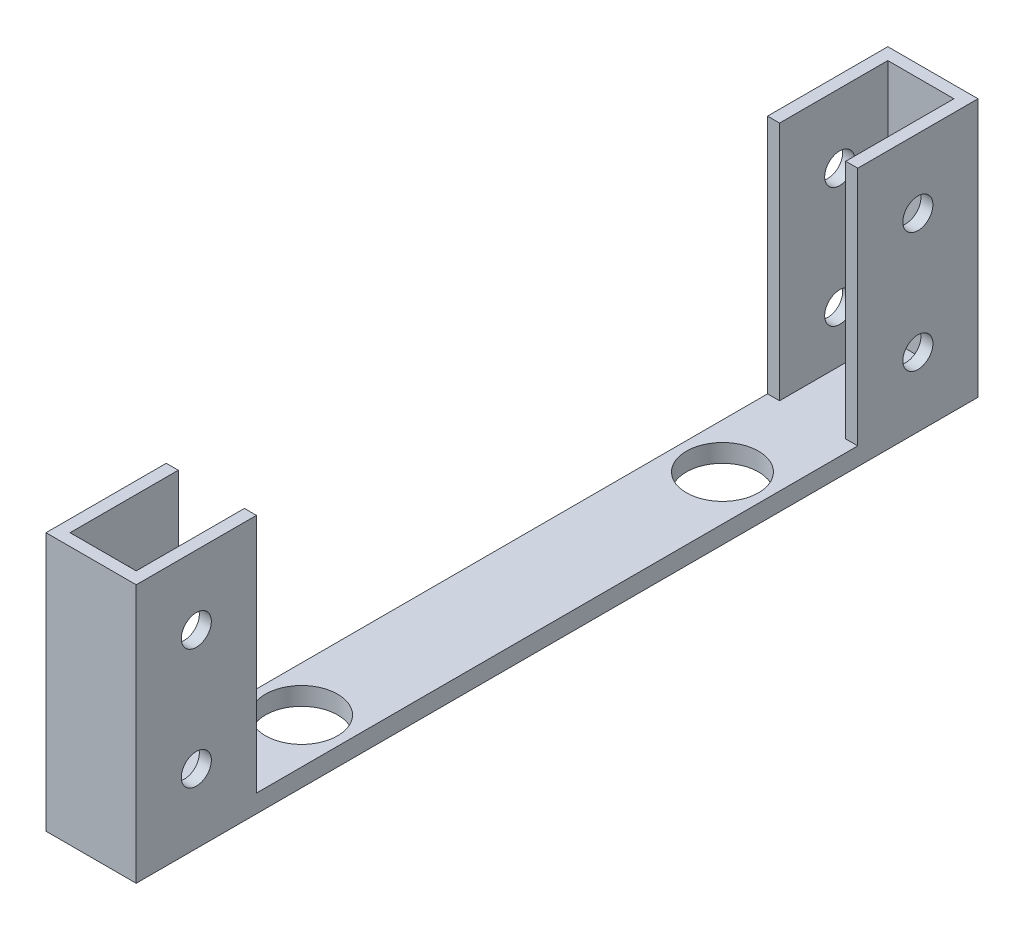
ISO-10303-21;
HEADER;
FILE_DESCRIPTION(('STEP AP214'),'2;1');
FILE_NAME('part.step','',(''),(''),'','','');
FILE_SCHEMA(('AUTOMOTIVE_DESIGN { 1 0 10303 214 1 1 1 1 }'));
ENDSEC;
DATA;
#1=APPLICATION_CONTEXT('core data for automotive mechanical design processes');
#2=APPLICATION_PROTOCOL_DEFINITION('international standard','automotive_design',2000,#1);
#3=PRODUCT_CONTEXT('',#1,'mechanical');
#4=PRODUCT('Part','Part','',(#3));
#5=PRODUCT_RELATED_PRODUCT_CATEGORY('part','',(#4));
#6=PRODUCT_DEFINITION_FORMATION('','',#4);
#7=PRODUCT_DEFINITION_CONTEXT('part definition',#1,'design');
#8=PRODUCT_DEFINITION('design','',#6,#7);
#9=PRODUCT_DEFINITION_SHAPE('','',#8);
#10=(LENGTH_UNIT() NAMED_UNIT(*) SI_UNIT(.MILLI.,.METRE.));
#11=(NAMED_UNIT(*) PLANE_ANGLE_UNIT() SI_UNIT($,.RADIAN.));
#12=(NAMED_UNIT(*) SI_UNIT($,.STERADIAN.) SOLID_ANGLE_UNIT());
#13=UNCERTAINTY_MEASURE_WITH_UNIT(LENGTH_MEASURE(1.E-05),#10,'distance_accuracy_value','');
#14=(GEOMETRIC_REPRESENTATION_CONTEXT(3) GLOBAL_UNCERTAINTY_ASSIGNED_CONTEXT((#13)) GLOBAL_UNIT_ASSIGNED_CONTEXT((#10,
#11,#12)) REPRESENTATION_CONTEXT('',''));
#15=CARTESIAN_POINT('',(0.,0.,0.));
#16=DIRECTION('',(0.,0.,1.));
#17=DIRECTION('',(1.,0.,0.));
#18=AXIS2_PLACEMENT_3D('',#15,#16,#17);
#19=CARTESIAN_POINT('',(0.,3.,0.));
#20=DIRECTION('',(0.,1.,0.));
#21=DIRECTION('',(0.,0.,1.));
#22=AXIS2_PLACEMENT_3D('',#19,#20,#21);
#23=PLANE('',#22);
#24=CARTESIAN_POINT('',(0.,3.,35.));
#25=DIRECTION('',(0.,1.,0.));
#26=DIRECTION('',(0.,0.,1.));
#27=AXIS2_PLACEMENT_3D('',#24,#25,#26);
#28=CIRCLE('',#27,6.);
#29=CARTESIAN_POINT('',(0.,3.,41.));
#30=VERTEX_POINT('',#29);
#31=EDGE_CURVE('E264',#30,#30,#28,.T.);
#32=ORIENTED_EDGE('',*,*,#31,.F.);
#33=EDGE_LOOP('',(#32));
#34=FACE_BOUND('',#33,.T.);
#35=CARTESIAN_POINT('',(0.,3.,-35.));
#36=DIRECTION('',(0.,1.,0.));
#37=DIRECTION('',(0.,0.,1.));
#38=AXIS2_PLACEMENT_3D('',#35,#36,#37);
#39=CIRCLE('',#38,6.);
#40=CARTESIAN_POINT('',(0.,3.,-29.));
#41=VERTEX_POINT('',#40);
#42=EDGE_CURVE('E258',#41,#41,#39,.T.);
#43=ORIENTED_EDGE('',*,*,#42,.F.);
#44=EDGE_LOOP('',(#43));
#45=FACE_BOUND('',#44,.T.);
#46=DIRECTION('',(0.,0.,1.));
#47=VECTOR('',#46,1.);
#48=CARTESIAN_POINT('',(5.5,3.,68.));
#49=LINE('',#48,#47);
#50=CARTESIAN_POINT('',(5.5,3.,50.));
#51=VERTEX_POINT('',#50);
#52=CARTESIAN_POINT('',(5.5,3.,68.));
#53=VERTEX_POINT('',#52);
#54=EDGE_CURVE('E57',#51,#53,#49,.T.);
#55=ORIENTED_EDGE('',*,*,#54,.F.);
#56=DIRECTION('',(-1.,0.,0.));
#57=VECTOR('',#56,1.);
#58=CARTESIAN_POINT('',(5.5,3.,50.));
#59=LINE('',#58,#57);
#60=CARTESIAN_POINT('',(7.5,3.,50.));
#61=VERTEX_POINT('',#60);
#62=EDGE_CURVE('E332',#61,#51,#59,.T.);
#63=ORIENTED_EDGE('',*,*,#62,.F.);
#64=DIRECTION('',(0.,0.,-1.));
#65=VECTOR('',#64,1.);
#66=CARTESIAN_POINT('',(7.5,3.,70.));
#67=LINE('',#66,#65);
#68=CARTESIAN_POINT('',(7.5,3.,-50.));
#69=VERTEX_POINT('',#68);
#70=EDGE_CURVE('E180',#61,#69,#67,.T.);
#71=ORIENTED_EDGE('',*,*,#70,.T.);
#72=DIRECTION('',(1.,0.,0.));
#73=VECTOR('',#72,1.);
#74=CARTESIAN_POINT('',(5.5,3.,-50.));
#75=LINE('',#74,#73);
#76=CARTESIAN_POINT('',(5.5,3.,-50.));
#77=VERTEX_POINT('',#76);
#78=EDGE_CURVE('E198',#77,#69,#75,.T.);
#79=ORIENTED_EDGE('',*,*,#78,.F.);
#80=DIRECTION('',(0.,0.,1.));
#81=VECTOR('',#80,1.);
#82=CARTESIAN_POINT('',(5.5,3.,-50.));
#83=LINE('',#82,#81);
#84=CARTESIAN_POINT('',(5.5,3.,-68.));
#85=VERTEX_POINT('',#84);
#86=EDGE_CURVE('E229',#85,#77,#83,.T.);
#87=ORIENTED_EDGE('',*,*,#86,.F.);
#88=DIRECTION('',(1.,0.,0.));
#89=VECTOR('',#88,1.);
#90=CARTESIAN_POINT('',(5.5,3.,-68.));
#91=LINE('',#90,#89);
#92=CARTESIAN_POINT('',(-5.5,3.,-68.));
#93=VERTEX_POINT('',#92);
#94=EDGE_CURVE('E225',#93,#85,#91,.T.);
#95=ORIENTED_EDGE('',*,*,#94,.F.);
#96=DIRECTION('',(0.,0.,-1.));
#97=VECTOR('',#96,1.);
#98=CARTESIAN_POINT('',(-5.5,3.,-50.));
#99=LINE('',#98,#97);
#100=CARTESIAN_POINT('',(-5.5,3.,-50.));
#101=VERTEX_POINT('',#100);
#102=EDGE_CURVE('E187',#101,#93,#99,.T.);
#103=ORIENTED_EDGE('',*,*,#102,.F.);
#104=DIRECTION('',(1.,0.,0.));
#105=VECTOR('',#104,1.);
#106=CARTESIAN_POINT('',(-5.5,3.,-50.));
#107=LINE('',#106,#105);
#108=CARTESIAN_POINT('',(-7.5,3.,-50.));
#109=VERTEX_POINT('',#108);
#110=EDGE_CURVE('E182',#109,#101,#107,.T.);
#111=ORIENTED_EDGE('',*,*,#110,.F.);
#112=DIRECTION('',(0.,0.,1.));
#113=VECTOR('',#112,1.);
#114=CARTESIAN_POINT('',(-7.5,3.,70.));
#115=LINE('',#114,#113);
#116=CARTESIAN_POINT('',(-7.5,3.,50.));
#117=VERTEX_POINT('',#116);
#118=EDGE_CURVE('E275',#109,#117,#115,.T.);
#119=ORIENTED_EDGE('',*,*,#118,.T.);
#120=DIRECTION('',(-1.,0.,0.));
#121=VECTOR('',#120,1.);
#122=CARTESIAN_POINT('',(-5.5,3.,50.));
#123=LINE('',#122,#121);
#124=CARTESIAN_POINT('',(-5.5,3.,50.));
#125=VERTEX_POINT('',#124);
#126=EDGE_CURVE('E175',#125,#117,#123,.T.);
#127=ORIENTED_EDGE('',*,*,#126,.F.);
#128=DIRECTION('',(0.,0.,-1.));
#129=VECTOR('',#128,1.);
#130=CARTESIAN_POINT('',(-5.5,3.,68.));
#131=LINE('',#130,#129);
#132=CARTESIAN_POINT('',(-5.5,3.,68.));
#133=VERTEX_POINT('',#132);
#134=EDGE_CURVE('E357',#133,#125,#131,.T.);
#135=ORIENTED_EDGE('',*,*,#134,.F.);
#136=DIRECTION('',(-1.,0.,0.));
#137=VECTOR('',#136,1.);
#138=CARTESIAN_POINT('',(5.5,3.,68.));
#139=LINE('',#138,#137);
#140=EDGE_CURVE('E62',#53,#133,#139,.T.);
#141=ORIENTED_EDGE('',*,*,#140,.F.);
#142=EDGE_LOOP('',(#55,#63,#71,#79,#87,#95,#103,#111,#119,#127,#135,#141));
#143=FACE_BOUND('',#142,.T.);
#144=ADVANCED_FACE('F39',(#34,#45,#143),#23,.T.);
#145=CARTESIAN_POINT('',(-7.5,3.,70.));
#146=DIRECTION('',(1.,0.,0.));
#147=DIRECTION('',(0.,0.,-1.));
#148=AXIS2_PLACEMENT_3D('',#145,#146,#147);
#149=PLANE('',#148);
#150=CARTESIAN_POINT('',(-7.5,11.5,60.));
#151=DIRECTION('',(1.,0.,0.));
#152=DIRECTION('',(0.,0.,-1.));
#153=AXIS2_PLACEMENT_3D('',#150,#151,#152);
#154=CIRCLE('',#153,2.5);
#155=CARTESIAN_POINT('',(-7.5,11.5,57.5));
#156=VERTEX_POINT('',#155);
#157=EDGE_CURVE('E705',#156,#156,#154,.T.);
#158=ORIENTED_EDGE('',*,*,#157,.T.);
#159=EDGE_LOOP('',(#158));
#160=FACE_BOUND('',#159,.T.);
#161=CARTESIAN_POINT('',(-7.5,31.5,-60.));
#162=DIRECTION('',(1.,0.,0.));
#163=DIRECTION('',(0.,0.,-1.));
#164=AXIS2_PLACEMENT_3D('',#161,#162,#163);
#165=CIRCLE('',#164,2.5);
#166=CARTESIAN_POINT('',(-7.5,31.5,-62.5));
#167=VERTEX_POINT('',#166);
#168=EDGE_CURVE('E692',#167,#167,#165,.T.);
#169=ORIENTED_EDGE('',*,*,#168,.T.);
#170=EDGE_LOOP('',(#169));
#171=FACE_BOUND('',#170,.T.);
#172=CARTESIAN_POINT('',(-7.5,11.5,-60.));
#173=DIRECTION('',(1.,0.,0.));
#174=DIRECTION('',(0.,0.,-1.));
#175=AXIS2_PLACEMENT_3D('',#172,#173,#174);
#176=CIRCLE('',#175,2.5);
#177=CARTESIAN_POINT('',(-7.5,11.5,-62.5));
#178=VERTEX_POINT('',#177);
#179=EDGE_CURVE('E708',#178,#178,#176,.T.);
#180=ORIENTED_EDGE('',*,*,#179,.T.);
#181=EDGE_LOOP('',(#180));
#182=FACE_BOUND('',#181,.T.);
#183=CARTESIAN_POINT('',(-7.5,31.5,60.));
#184=DIRECTION('',(1.,0.,0.));
#185=DIRECTION('',(0.,0.,-1.));
#186=AXIS2_PLACEMENT_3D('',#183,#184,#185);
#187=CIRCLE('',#186,2.5);
#188=CARTESIAN_POINT('',(-7.5,31.5,57.5));
#189=VERTEX_POINT('',#188);
#190=EDGE_CURVE('E307',#189,#189,#187,.T.);
#191=ORIENTED_EDGE('',*,*,#190,.T.);
#192=EDGE_LOOP('',(#191));
#193=FACE_BOUND('',#192,.T.);
#194=DIRECTION('',(0.,0.,1.));
#195=VECTOR('',#194,1.);
#196=CARTESIAN_POINT('',(-7.5,0.,70.));
#197=LINE('',#196,#195);
#198=CARTESIAN_POINT('',(-7.5,0.,-70.));
#199=VERTEX_POINT('',#198);
#200=CARTESIAN_POINT('',(-7.5,0.,70.));
#201=VERTEX_POINT('',#200);
#202=EDGE_CURVE('E263',#199,#201,#197,.T.);
#203=ORIENTED_EDGE('',*,*,#202,.T.);
#204=DIRECTION('',(0.,-1.,0.));
#205=VECTOR('',#204,1.);
#206=CARTESIAN_POINT('',(-7.5,3.,70.));
#207=LINE('',#206,#205);
#208=CARTESIAN_POINT('',(-7.5,43.,70.));
#209=VERTEX_POINT('',#208);
#210=EDGE_CURVE('E11',#209,#201,#207,.T.);
#211=ORIENTED_EDGE('',*,*,#210,.F.);
#212=DIRECTION('',(0.,0.,1.));
#213=VECTOR('',#212,1.);
#214=CARTESIAN_POINT('',(-7.5,43.,50.));
#215=LINE('',#214,#213);
#216=CARTESIAN_POINT('',(-7.5,43.,50.));
#217=VERTEX_POINT('',#216);
#218=EDGE_CURVE('E345',#217,#209,#215,.T.);
#219=ORIENTED_EDGE('',*,*,#218,.F.);
#220=DIRECTION('',(0.,-1.,0.));
#221=VECTOR('',#220,1.);
#222=CARTESIAN_POINT('',(-7.5,43.,50.));
#223=LINE('',#222,#221);
#224=EDGE_CURVE('E350',#217,#117,#223,.T.);
#225=ORIENTED_EDGE('',*,*,#224,.T.);
#226=ORIENTED_EDGE('',*,*,#118,.F.);
#227=DIRECTION('',(0.,-1.,0.));
#228=VECTOR('',#227,1.);
#229=CARTESIAN_POINT('',(-7.5,43.,-50.));
#230=LINE('',#229,#228);
#231=CARTESIAN_POINT('',(-7.5,43.,-50.));
#232=VERTEX_POINT('',#231);
#233=EDGE_CURVE('E254',#232,#109,#230,.T.);
#234=ORIENTED_EDGE('',*,*,#233,.F.);
#235=DIRECTION('',(0.,0.,1.));
#236=VECTOR('',#235,1.);
#237=CARTESIAN_POINT('',(-7.5,43.,-70.));
#238=LINE('',#237,#236);
#239=CARTESIAN_POINT('',(-7.5,43.,-70.));
#240=VERTEX_POINT('',#239);
#241=EDGE_CURVE('E193',#240,#232,#238,.T.);
#242=ORIENTED_EDGE('',*,*,#241,.F.);
#243=DIRECTION('',(0.,-1.,0.));
#244=VECTOR('',#243,1.);
#245=CARTESIAN_POINT('',(-7.5,3.,-70.));
#246=LINE('',#245,#244);
#247=EDGE_CURVE('E281',#240,#199,#246,.T.);
#248=ORIENTED_EDGE('',*,*,#247,.T.);
#249=EDGE_LOOP('',(#203,#211,#219,#225,#226,#234,#242,#248));
#250=FACE_BOUND('',#249,.T.);
#251=ADVANCED_FACE('F41',(#160,#171,#182,#193,#250),#149,.F.);
#252=CARTESIAN_POINT('',(7.5,3.,70.));
#253=DIRECTION('',(0.,0.,-1.));
#254=DIRECTION('',(-1.,0.,0.));
#255=AXIS2_PLACEMENT_3D('',#252,#253,#254);
#256=PLANE('',#255);
#257=DIRECTION('',(1.,0.,0.));
#258=VECTOR('',#257,1.);
#259=CARTESIAN_POINT('',(7.5,0.,70.));
#260=LINE('',#259,#258);
#261=CARTESIAN_POINT('',(7.5,0.,70.));
#262=VERTEX_POINT('',#261);
#263=EDGE_CURVE('E285',#201,#262,#260,.T.);
#264=ORIENTED_EDGE('',*,*,#263,.T.);
#265=DIRECTION('',(0.,-1.,0.));
#266=VECTOR('',#265,1.);
#267=CARTESIAN_POINT('',(7.5,3.,70.));
#268=LINE('',#267,#266);
#269=CARTESIAN_POINT('',(7.5,43.,70.));
#270=VERTEX_POINT('',#269);
#271=EDGE_CURVE('E49',#270,#262,#268,.T.);
#272=ORIENTED_EDGE('',*,*,#271,.F.);
#273=DIRECTION('',(1.,0.,0.));
#274=VECTOR('',#273,1.);
#275=CARTESIAN_POINT('',(-7.5,43.,70.));
#276=LINE('',#275,#274);
#277=EDGE_CURVE('E171',#209,#270,#276,.T.);
#278=ORIENTED_EDGE('',*,*,#277,.F.);
#279=ORIENTED_EDGE('',*,*,#210,.T.);
#280=EDGE_LOOP('',(#264,#272,#278,#279));
#281=FACE_BOUND('',#280,.T.);
#282=ADVANCED_FACE('F394',(#281),#256,.F.);
#283=CARTESIAN_POINT('',(7.5,3.,70.));
#284=DIRECTION('',(-1.,0.,0.));
#285=DIRECTION('',(0.,0.,1.));
#286=AXIS2_PLACEMENT_3D('',#283,#284,#285);
#287=PLANE('',#286);
#288=CARTESIAN_POINT('',(7.5,11.5,60.));
#289=DIRECTION('',(1.,0.,0.));
#290=DIRECTION('',(0.,0.,-1.));
#291=AXIS2_PLACEMENT_3D('',#288,#289,#290);
#292=CIRCLE('',#291,2.5);
#293=CARTESIAN_POINT('',(7.5,11.5,57.5));
#294=VERTEX_POINT('',#293);
#295=EDGE_CURVE('E699',#294,#294,#292,.T.);
#296=ORIENTED_EDGE('',*,*,#295,.F.);
#297=EDGE_LOOP('',(#296));
#298=FACE_BOUND('',#297,.T.);
#299=CARTESIAN_POINT('',(7.5,31.5,-60.));
#300=DIRECTION('',(1.,0.,0.));
#301=DIRECTION('',(0.,0.,-1.));
#302=AXIS2_PLACEMENT_3D('',#299,#300,#301);
#303=CIRCLE('',#302,2.5);
#304=CARTESIAN_POINT('',(7.5,31.5,-62.5));
#305=VERTEX_POINT('',#304);
#306=EDGE_CURVE('E700',#305,#305,#303,.T.);
#307=ORIENTED_EDGE('',*,*,#306,.F.);
#308=EDGE_LOOP('',(#307));
#309=FACE_BOUND('',#308,.T.);
#310=CARTESIAN_POINT('',(7.5,11.5,-60.));
#311=DIRECTION('',(1.,0.,0.));
#312=DIRECTION('',(0.,0.,-1.));
#313=AXIS2_PLACEMENT_3D('',#310,#311,#312);
#314=CIRCLE('',#313,2.5);
#315=CARTESIAN_POINT('',(7.5,11.5,-62.5));
#316=VERTEX_POINT('',#315);
#317=EDGE_CURVE('E722',#316,#316,#314,.T.);
#318=ORIENTED_EDGE('',*,*,#317,.F.);
#319=EDGE_LOOP('',(#318));
#320=FACE_BOUND('',#319,.T.);
#321=CARTESIAN_POINT('',(7.5,31.5,60.));
#322=DIRECTION('',(1.,0.,0.));
#323=DIRECTION('',(0.,0.,-1.));
#324=AXIS2_PLACEMENT_3D('',#321,#322,#323);
#325=CIRCLE('',#324,2.5);
#326=CARTESIAN_POINT('',(7.5,31.5,57.5));
#327=VERTEX_POINT('',#326);
#328=EDGE_CURVE('E714',#327,#327,#325,.T.);
#329=ORIENTED_EDGE('',*,*,#328,.F.);
#330=EDGE_LOOP('',(#329));
#331=FACE_BOUND('',#330,.T.);
#332=DIRECTION('',(0.,0.,-1.));
#333=VECTOR('',#332,1.);
#334=CARTESIAN_POINT('',(7.5,0.,70.));
#335=LINE('',#334,#333);
#336=CARTESIAN_POINT('',(7.5,0.,-70.));
#337=VERTEX_POINT('',#336);
#338=EDGE_CURVE('E288',#262,#337,#335,.T.);
#339=ORIENTED_EDGE('',*,*,#338,.T.);
#340=DIRECTION('',(0.,-1.,0.));
#341=VECTOR('',#340,1.);
#342=CARTESIAN_POINT('',(7.5,3.,-70.));
#343=LINE('',#342,#341);
#344=CARTESIAN_POINT('',(7.5,43.,-70.));
#345=VERTEX_POINT('',#344);
#346=EDGE_CURVE('E296',#345,#337,#343,.T.);
#347=ORIENTED_EDGE('',*,*,#346,.F.);
#348=DIRECTION('',(0.,0.,-1.));
#349=VECTOR('',#348,1.);
#350=CARTESIAN_POINT('',(7.5,43.,-70.));
#351=LINE('',#350,#349);
#352=CARTESIAN_POINT('',(7.5,43.,-50.));
#353=VERTEX_POINT('',#352);
#354=EDGE_CURVE('E213',#353,#345,#351,.T.);
#355=ORIENTED_EDGE('',*,*,#354,.F.);
#356=DIRECTION('',(0.,-1.,0.));
#357=VECTOR('',#356,1.);
#358=CARTESIAN_POINT('',(7.5,43.,-50.));
#359=LINE('',#358,#357);
#360=EDGE_CURVE('E220',#353,#69,#359,.T.);
#361=ORIENTED_EDGE('',*,*,#360,.T.);
#362=ORIENTED_EDGE('',*,*,#70,.F.);
#363=DIRECTION('',(0.,-1.,0.));
#364=VECTOR('',#363,1.);
#365=CARTESIAN_POINT('',(7.5,43.,50.));
#366=LINE('',#365,#364);
#367=CARTESIAN_POINT('',(7.5,43.,50.));
#368=VERTEX_POINT('',#367);
#369=EDGE_CURVE('E157',#368,#61,#366,.T.);
#370=ORIENTED_EDGE('',*,*,#369,.F.);
#371=DIRECTION('',(0.,0.,-1.));
#372=VECTOR('',#371,1.);
#373=CARTESIAN_POINT('',(7.5,43.,50.));
#374=LINE('',#373,#372);
#375=EDGE_CURVE('E164',#270,#368,#374,.T.);
#376=ORIENTED_EDGE('',*,*,#375,.F.);
#377=ORIENTED_EDGE('',*,*,#271,.T.);
#378=EDGE_LOOP('',(#339,#347,#355,#361,#362,#370,#376,#377));
#379=FACE_BOUND('',#378,.T.);
#380=ADVANCED_FACE('F178',(#298,#309,#320,#331,#379),#287,.F.);
#381=CARTESIAN_POINT('',(7.5,3.,-70.));
#382=DIRECTION('',(0.,0.,1.));
#383=DIRECTION('',(1.,0.,0.));
#384=AXIS2_PLACEMENT_3D('',#381,#382,#383);
#385=PLANE('',#384);
#386=DIRECTION('',(-1.,0.,0.));
#387=VECTOR('',#386,1.);
#388=CARTESIAN_POINT('',(7.5,0.,-70.));
#389=LINE('',#388,#387);
#390=EDGE_CURVE('E278',#337,#199,#389,.T.);
#391=ORIENTED_EDGE('',*,*,#390,.T.);
#392=ORIENTED_EDGE('',*,*,#247,.F.);
#393=DIRECTION('',(-1.,0.,0.));
#394=VECTOR('',#393,1.);
#395=CARTESIAN_POINT('',(-7.5,43.,-70.));
#396=LINE('',#395,#394);
#397=EDGE_CURVE('E217',#345,#240,#396,.T.);
#398=ORIENTED_EDGE('',*,*,#397,.F.);
#399=ORIENTED_EDGE('',*,*,#346,.T.);
#400=EDGE_LOOP('',(#391,#392,#398,#399));
#401=FACE_BOUND('',#400,.T.);
#402=ADVANCED_FACE('F401',(#401),#385,.F.);
#403=CARTESIAN_POINT('',(0.,0.,0.));
#404=DIRECTION('',(0.,1.,0.));
#405=DIRECTION('',(0.,0.,1.));
#406=AXIS2_PLACEMENT_3D('',#403,#404,#405);
#407=PLANE('',#406);
#408=CARTESIAN_POINT('',(0.,0.,35.));
#409=DIRECTION('',(0.,1.,0.));
#410=DIRECTION('',(0.,0.,1.));
#411=AXIS2_PLACEMENT_3D('',#408,#409,#410);
#412=CIRCLE('',#411,6.);
#413=CARTESIAN_POINT('',(0.,0.,41.));
#414=VERTEX_POINT('',#413);
#415=EDGE_CURVE('E259',#414,#414,#412,.T.);
#416=ORIENTED_EDGE('',*,*,#415,.T.);
#417=EDGE_LOOP('',(#416));
#418=FACE_BOUND('',#417,.T.);
#419=CARTESIAN_POINT('',(0.,0.,-35.));
#420=DIRECTION('',(0.,1.,0.));
#421=DIRECTION('',(0.,0.,1.));
#422=AXIS2_PLACEMENT_3D('',#419,#420,#421);
#423=CIRCLE('',#422,6.);
#424=CARTESIAN_POINT('',(0.,0.,-29.));
#425=VERTEX_POINT('',#424);
#426=EDGE_CURVE('E268',#425,#425,#423,.T.);
#427=ORIENTED_EDGE('',*,*,#426,.T.);
#428=EDGE_LOOP('',(#427));
#429=FACE_BOUND('',#428,.T.);
#430=ORIENTED_EDGE('',*,*,#202,.F.);
#431=ORIENTED_EDGE('',*,*,#390,.F.);
#432=ORIENTED_EDGE('',*,*,#338,.F.);
#433=ORIENTED_EDGE('',*,*,#263,.F.);
#434=EDGE_LOOP('',(#430,#431,#432,#433));
#435=FACE_BOUND('',#434,.T.);
#436=ADVANCED_FACE('F399',(#418,#429,#435),#407,.F.);
#437=CARTESIAN_POINT('',(0.,0.,-35.));
#438=DIRECTION('',(0.,1.,0.));
#439=DIRECTION('',(0.,0.,1.));
#440=AXIS2_PLACEMENT_3D('',#437,#438,#439);
#441=CYLINDRICAL_SURFACE('',#440,6.);
#442=ORIENTED_EDGE('',*,*,#426,.F.);
#443=EDGE_LOOP('',(#442));
#444=FACE_BOUND('',#443,.T.);
#445=ORIENTED_EDGE('',*,*,#42,.T.);
#446=EDGE_LOOP('',(#445));
#447=FACE_BOUND('',#446,.T.);
#448=ADVANCED_FACE('F437',(#444,#447),#441,.F.);
#449=CARTESIAN_POINT('',(0.,0.,35.));
#450=DIRECTION('',(0.,1.,0.));
#451=DIRECTION('',(0.,0.,1.));
#452=AXIS2_PLACEMENT_3D('',#449,#450,#451);
#453=CYLINDRICAL_SURFACE('',#452,6.);
#454=ORIENTED_EDGE('',*,*,#415,.F.);
#455=EDGE_LOOP('',(#454));
#456=FACE_BOUND('',#455,.T.);
#457=ORIENTED_EDGE('',*,*,#31,.T.);
#458=EDGE_LOOP('',(#457));
#459=FACE_BOUND('',#458,.T.);
#460=ADVANCED_FACE('F429',(#456,#459),#453,.F.);
#461=CARTESIAN_POINT('',(-5.5,43.,-50.));
#462=DIRECTION('',(0.,0.,-1.));
#463=DIRECTION('',(-1.,0.,0.));
#464=AXIS2_PLACEMENT_3D('',#461,#462,#463);
#465=PLANE('',#464);
#466=ORIENTED_EDGE('',*,*,#110,.T.);
#467=DIRECTION('',(0.,-1.,0.));
#468=VECTOR('',#467,1.);
#469=CARTESIAN_POINT('',(-5.5,43.,-50.));
#470=LINE('',#469,#468);
#471=CARTESIAN_POINT('',(-5.5,43.,-50.));
#472=VERTEX_POINT('',#471);
#473=EDGE_CURVE('E250',#472,#101,#470,.T.);
#474=ORIENTED_EDGE('',*,*,#473,.F.);
#475=DIRECTION('',(1.,0.,0.));
#476=VECTOR('',#475,1.);
#477=CARTESIAN_POINT('',(-5.5,43.,-50.));
#478=LINE('',#477,#476);
#479=EDGE_CURVE('E197',#232,#472,#478,.T.);
#480=ORIENTED_EDGE('',*,*,#479,.F.);
#481=ORIENTED_EDGE('',*,*,#233,.T.);
#482=EDGE_LOOP('',(#466,#474,#480,#481));
#483=FACE_BOUND('',#482,.T.);
#484=ADVANCED_FACE('F427',(#483),#465,.F.);
#485=CARTESIAN_POINT('',(-5.5,43.,-50.));
#486=DIRECTION('',(-1.,0.,0.));
#487=DIRECTION('',(0.,0.,1.));
#488=AXIS2_PLACEMENT_3D('',#485,#486,#487);
#489=PLANE('',#488);
#490=CARTESIAN_POINT('',(-5.5,31.5,-60.));
#491=DIRECTION('',(-1.,0.,0.));
#492=DIRECTION('',(0.,0.,1.));
#493=AXIS2_PLACEMENT_3D('',#490,#491,#492);
#494=CIRCLE('',#493,2.5);
#495=CARTESIAN_POINT('',(-5.5,31.5,-57.5));
#496=VERTEX_POINT('',#495);
#497=EDGE_CURVE('E329',#496,#496,#494,.T.);
#498=ORIENTED_EDGE('',*,*,#497,.T.);
#499=EDGE_LOOP('',(#498));
#500=FACE_BOUND('',#499,.T.);
#501=CARTESIAN_POINT('',(-5.5,11.5,-60.));
#502=DIRECTION('',(-1.,0.,0.));
#503=DIRECTION('',(0.,0.,1.));
#504=AXIS2_PLACEMENT_3D('',#501,#502,#503);
#505=CIRCLE('',#504,2.5);
#506=CARTESIAN_POINT('',(-5.5,11.5,-57.5));
#507=VERTEX_POINT('',#506);
#508=EDGE_CURVE('E315',#507,#507,#505,.T.);
#509=ORIENTED_EDGE('',*,*,#508,.T.);
#510=EDGE_LOOP('',(#509));
#511=FACE_BOUND('',#510,.T.);
#512=ORIENTED_EDGE('',*,*,#102,.T.);
#513=DIRECTION('',(0.,-1.,0.));
#514=VECTOR('',#513,1.);
#515=CARTESIAN_POINT('',(-5.5,43.,-68.));
#516=LINE('',#515,#514);
#517=CARTESIAN_POINT('',(-5.5,43.,-68.));
#518=VERTEX_POINT('',#517);
#519=EDGE_CURVE('E246',#518,#93,#516,.T.);
#520=ORIENTED_EDGE('',*,*,#519,.F.);
#521=DIRECTION('',(0.,0.,-1.));
#522=VECTOR('',#521,1.);
#523=CARTESIAN_POINT('',(-5.5,43.,-50.));
#524=LINE('',#523,#522);
#525=EDGE_CURVE('E201',#472,#518,#524,.T.);
#526=ORIENTED_EDGE('',*,*,#525,.F.);
#527=ORIENTED_EDGE('',*,*,#473,.T.);
#528=EDGE_LOOP('',(#512,#520,#526,#527));
#529=FACE_BOUND('',#528,.T.);
#530=ADVANCED_FACE('F424',(#500,#511,#529),#489,.F.);
#531=CARTESIAN_POINT('',(5.5,43.,-68.));
#532=DIRECTION('',(0.,0.,-1.));
#533=DIRECTION('',(-1.,0.,0.));
#534=AXIS2_PLACEMENT_3D('',#531,#532,#533);
#535=PLANE('',#534);
#536=ORIENTED_EDGE('',*,*,#94,.T.);
#537=DIRECTION('',(0.,-1.,0.));
#538=VECTOR('',#537,1.);
#539=CARTESIAN_POINT('',(5.5,43.,-68.));
#540=LINE('',#539,#538);
#541=CARTESIAN_POINT('',(5.5,43.,-68.));
#542=VERTEX_POINT('',#541);
#543=EDGE_CURVE('E242',#542,#85,#540,.T.);
#544=ORIENTED_EDGE('',*,*,#543,.F.);
#545=DIRECTION('',(1.,0.,0.));
#546=VECTOR('',#545,1.);
#547=CARTESIAN_POINT('',(5.5,43.,-68.));
#548=LINE('',#547,#546);
#549=EDGE_CURVE('E204',#518,#542,#548,.T.);
#550=ORIENTED_EDGE('',*,*,#549,.F.);
#551=ORIENTED_EDGE('',*,*,#519,.T.);
#552=EDGE_LOOP('',(#536,#544,#550,#551));
#553=FACE_BOUND('',#552,.T.);
#554=ADVANCED_FACE('F421',(#553),#535,.F.);
#555=CARTESIAN_POINT('',(5.5,43.,-50.));
#556=DIRECTION('',(1.,0.,0.));
#557=DIRECTION('',(0.,0.,-1.));
#558=AXIS2_PLACEMENT_3D('',#555,#556,#557);
#559=PLANE('',#558);
#560=CARTESIAN_POINT('',(5.5,31.5,-60.));
#561=DIRECTION('',(1.,0.,0.));
#562=DIRECTION('',(0.,0.,-1.));
#563=AXIS2_PLACEMENT_3D('',#560,#561,#562);
#564=CIRCLE('',#563,2.5);
#565=CARTESIAN_POINT('',(5.5,31.5,-62.5));
#566=VERTEX_POINT('',#565);
#567=EDGE_CURVE('E43',#566,#566,#564,.T.);
#568=ORIENTED_EDGE('',*,*,#567,.T.);
#569=EDGE_LOOP('',(#568));
#570=FACE_BOUND('',#569,.T.);
#571=CARTESIAN_POINT('',(5.5,11.5,-60.));
#572=DIRECTION('',(1.,0.,0.));
#573=DIRECTION('',(0.,0.,-1.));
#574=AXIS2_PLACEMENT_3D('',#571,#572,#573);
#575=CIRCLE('',#574,2.5);
#576=CARTESIAN_POINT('',(5.5,11.5,-62.5));
#577=VERTEX_POINT('',#576);
#578=EDGE_CURVE('E312',#577,#577,#575,.T.);
#579=ORIENTED_EDGE('',*,*,#578,.T.);
#580=EDGE_LOOP('',(#579));
#581=FACE_BOUND('',#580,.T.);
#582=ORIENTED_EDGE('',*,*,#86,.T.);
#583=DIRECTION('',(0.,-1.,0.));
#584=VECTOR('',#583,1.);
#585=CARTESIAN_POINT('',(5.5,43.,-50.));
#586=LINE('',#585,#584);
#587=CARTESIAN_POINT('',(5.5,43.,-50.));
#588=VERTEX_POINT('',#587);
#589=EDGE_CURVE('E238',#588,#77,#586,.T.);
#590=ORIENTED_EDGE('',*,*,#589,.F.);
#591=DIRECTION('',(0.,0.,1.));
#592=VECTOR('',#591,1.);
#593=CARTESIAN_POINT('',(5.5,43.,-50.));
#594=LINE('',#593,#592);
#595=EDGE_CURVE('E207',#542,#588,#594,.T.);
#596=ORIENTED_EDGE('',*,*,#595,.F.);
#597=ORIENTED_EDGE('',*,*,#543,.T.);
#598=EDGE_LOOP('',(#582,#590,#596,#597));
#599=FACE_BOUND('',#598,.T.);
#600=ADVANCED_FACE('F416',(#570,#581,#599),#559,.F.);
#601=CARTESIAN_POINT('',(5.5,43.,-50.));
#602=DIRECTION('',(0.,0.,-1.));
#603=DIRECTION('',(-1.,0.,0.));
#604=AXIS2_PLACEMENT_3D('',#601,#602,#603);
#605=PLANE('',#604);
#606=ORIENTED_EDGE('',*,*,#78,.T.);
#607=ORIENTED_EDGE('',*,*,#360,.F.);
#608=DIRECTION('',(1.,0.,0.));
#609=VECTOR('',#608,1.);
#610=CARTESIAN_POINT('',(5.5,43.,-50.));
#611=LINE('',#610,#609);
#612=EDGE_CURVE('E210',#588,#353,#611,.T.);
#613=ORIENTED_EDGE('',*,*,#612,.F.);
#614=ORIENTED_EDGE('',*,*,#589,.T.);
#615=EDGE_LOOP('',(#606,#607,#613,#614));
#616=FACE_BOUND('',#615,.T.);
#617=ADVANCED_FACE('F413',(#616),#605,.F.);
#618=CARTESIAN_POINT('',(0.,43.,0.));
#619=DIRECTION('',(0.,-1.,0.));
#620=DIRECTION('',(0.,0.,-1.));
#621=AXIS2_PLACEMENT_3D('',#618,#619,#620);
#622=PLANE('',#621);
#623=ORIENTED_EDGE('',*,*,#241,.T.);
#624=ORIENTED_EDGE('',*,*,#479,.T.);
#625=ORIENTED_EDGE('',*,*,#525,.T.);
#626=ORIENTED_EDGE('',*,*,#549,.T.);
#627=ORIENTED_EDGE('',*,*,#595,.T.);
#628=ORIENTED_EDGE('',*,*,#612,.T.);
#629=ORIENTED_EDGE('',*,*,#354,.T.);
#630=ORIENTED_EDGE('',*,*,#397,.T.);
#631=EDGE_LOOP('',(#623,#624,#625,#626,#627,#628,#629,#630));
#632=FACE_BOUND('',#631,.T.);
#633=ADVANCED_FACE('F407',(#632),#622,.F.);
#634=CARTESIAN_POINT('',(5.5,43.,50.));
#635=DIRECTION('',(0.,0.,1.));
#636=DIRECTION('',(1.,0.,0.));
#637=AXIS2_PLACEMENT_3D('',#634,#635,#636);
#638=PLANE('',#637);
#639=ORIENTED_EDGE('',*,*,#62,.T.);
#640=DIRECTION('',(0.,-1.,0.));
#641=VECTOR('',#640,1.);
#642=CARTESIAN_POINT('',(5.5,43.,50.));
#643=LINE('',#642,#641);
#644=CARTESIAN_POINT('',(5.5,43.,50.));
#645=VERTEX_POINT('',#644);
#646=EDGE_CURVE('E159',#645,#51,#643,.T.);
#647=ORIENTED_EDGE('',*,*,#646,.F.);
#648=DIRECTION('',(-1.,0.,0.));
#649=VECTOR('',#648,1.);
#650=CARTESIAN_POINT('',(5.5,43.,50.));
#651=LINE('',#650,#649);
#652=EDGE_CURVE('E153',#368,#645,#651,.T.);
#653=ORIENTED_EDGE('',*,*,#652,.F.);
#654=ORIENTED_EDGE('',*,*,#369,.T.);
#655=EDGE_LOOP('',(#639,#647,#653,#654));
#656=FACE_BOUND('',#655,.T.);
#657=ADVANCED_FACE('F155',(#656),#638,.F.);
#658=CARTESIAN_POINT('',(5.5,43.,68.));
#659=DIRECTION('',(1.,0.,0.));
#660=DIRECTION('',(0.,0.,-1.));
#661=AXIS2_PLACEMENT_3D('',#658,#659,#660);
#662=PLANE('',#661);
#663=CARTESIAN_POINT('',(5.5,11.5,60.));
#664=DIRECTION('',(1.,0.,0.));
#665=DIRECTION('',(0.,0.,-1.));
#666=AXIS2_PLACEMENT_3D('',#663,#664,#665);
#667=CIRCLE('',#666,2.5);
#668=CARTESIAN_POINT('',(5.5,11.5,57.5));
#669=VERTEX_POINT('',#668);
#670=EDGE_CURVE('E311',#669,#669,#667,.T.);
#671=ORIENTED_EDGE('',*,*,#670,.T.);
#672=EDGE_LOOP('',(#671));
#673=FACE_BOUND('',#672,.T.);
#674=CARTESIAN_POINT('',(5.5,31.5,60.));
#675=DIRECTION('',(1.,0.,0.));
#676=DIRECTION('',(0.,0.,-1.));
#677=AXIS2_PLACEMENT_3D('',#674,#675,#676);
#678=CIRCLE('',#677,2.5);
#679=CARTESIAN_POINT('',(5.5,31.5,57.5));
#680=VERTEX_POINT('',#679);
#681=EDGE_CURVE('E306',#680,#680,#678,.T.);
#682=ORIENTED_EDGE('',*,*,#681,.T.);
#683=EDGE_LOOP('',(#682));
#684=FACE_BOUND('',#683,.T.);
#685=ORIENTED_EDGE('',*,*,#54,.T.);
#686=DIRECTION('',(0.,-1.,0.));
#687=VECTOR('',#686,1.);
#688=CARTESIAN_POINT('',(5.5,43.,68.));
#689=LINE('',#688,#687);
#690=CARTESIAN_POINT('',(5.5,43.,68.));
#691=VERTEX_POINT('',#690);
#692=EDGE_CURVE('E189',#691,#53,#689,.T.);
#693=ORIENTED_EDGE('',*,*,#692,.F.);
#694=DIRECTION('',(0.,0.,1.));
#695=VECTOR('',#694,1.);
#696=CARTESIAN_POINT('',(5.5,43.,68.));
#697=LINE('',#696,#695);
#698=EDGE_CURVE('E163',#645,#691,#697,.T.);
#699=ORIENTED_EDGE('',*,*,#698,.F.);
#700=ORIENTED_EDGE('',*,*,#646,.T.);
#701=EDGE_LOOP('',(#685,#693,#699,#700));
#702=FACE_BOUND('',#701,.T.);
#703=ADVANCED_FACE('F382',(#673,#684,#702),#662,.F.);
#704=CARTESIAN_POINT('',(5.5,43.,68.));
#705=DIRECTION('',(0.,0.,1.));
#706=DIRECTION('',(1.,0.,0.));
#707=AXIS2_PLACEMENT_3D('',#704,#705,#706);
#708=PLANE('',#707);
#709=ORIENTED_EDGE('',*,*,#140,.T.);
#710=DIRECTION('',(0.,-1.,0.));
#711=VECTOR('',#710,1.);
#712=CARTESIAN_POINT('',(-5.5,43.,68.));
#713=LINE('',#712,#711);
#714=CARTESIAN_POINT('',(-5.5,43.,68.));
#715=VERTEX_POINT('',#714);
#716=EDGE_CURVE('E371',#715,#133,#713,.T.);
#717=ORIENTED_EDGE('',*,*,#716,.F.);
#718=DIRECTION('',(-1.,0.,0.));
#719=VECTOR('',#718,1.);
#720=CARTESIAN_POINT('',(5.5,43.,68.));
#721=LINE('',#720,#719);
#722=EDGE_CURVE('E336',#691,#715,#721,.T.);
#723=ORIENTED_EDGE('',*,*,#722,.F.);
#724=ORIENTED_EDGE('',*,*,#692,.T.);
#725=EDGE_LOOP('',(#709,#717,#723,#724));
#726=FACE_BOUND('',#725,.T.);
#727=ADVANCED_FACE('F379',(#726),#708,.F.);
#728=CARTESIAN_POINT('',(-5.5,43.,68.));
#729=DIRECTION('',(-1.,0.,0.));
#730=DIRECTION('',(0.,0.,1.));
#731=AXIS2_PLACEMENT_3D('',#728,#729,#730);
#732=PLANE('',#731);
#733=CARTESIAN_POINT('',(-5.5,11.5,60.));
#734=DIRECTION('',(-1.,0.,0.));
#735=DIRECTION('',(0.,0.,1.));
#736=AXIS2_PLACEMENT_3D('',#733,#734,#735);
#737=CIRCLE('',#736,2.5);
#738=CARTESIAN_POINT('',(-5.5,11.5,62.5));
#739=VERTEX_POINT('',#738);
#740=EDGE_CURVE('E308',#739,#739,#737,.T.);
#741=ORIENTED_EDGE('',*,*,#740,.T.);
#742=EDGE_LOOP('',(#741));
#743=FACE_BOUND('',#742,.T.);
#744=CARTESIAN_POINT('',(-5.5,31.5,60.));
#745=DIRECTION('',(-1.,0.,0.));
#746=DIRECTION('',(0.,0.,1.));
#747=AXIS2_PLACEMENT_3D('',#744,#745,#746);
#748=CIRCLE('',#747,2.5);
#749=CARTESIAN_POINT('',(-5.5,31.5,62.5));
#750=VERTEX_POINT('',#749);
#751=EDGE_CURVE('E302',#750,#750,#748,.T.);
#752=ORIENTED_EDGE('',*,*,#751,.T.);
#753=EDGE_LOOP('',(#752));
#754=FACE_BOUND('',#753,.T.);
#755=ORIENTED_EDGE('',*,*,#134,.T.);
#756=DIRECTION('',(0.,-1.,0.));
#757=VECTOR('',#756,1.);
#758=CARTESIAN_POINT('',(-5.5,43.,50.));
#759=LINE('',#758,#757);
#760=CARTESIAN_POINT('',(-5.5,43.,50.));
#761=VERTEX_POINT('',#760);
#762=EDGE_CURVE('E367',#761,#125,#759,.T.);
#763=ORIENTED_EDGE('',*,*,#762,.F.);
#764=DIRECTION('',(0.,0.,-1.));
#765=VECTOR('',#764,1.);
#766=CARTESIAN_POINT('',(-5.5,43.,68.));
#767=LINE('',#766,#765);
#768=EDGE_CURVE('E339',#715,#761,#767,.T.);
#769=ORIENTED_EDGE('',*,*,#768,.F.);
#770=ORIENTED_EDGE('',*,*,#716,.T.);
#771=EDGE_LOOP('',(#755,#763,#769,#770));
#772=FACE_BOUND('',#771,.T.);
#773=ADVANCED_FACE('F386',(#743,#754,#772),#732,.F.);
#774=CARTESIAN_POINT('',(-5.5,43.,50.));
#775=DIRECTION('',(0.,0.,1.));
#776=DIRECTION('',(1.,0.,0.));
#777=AXIS2_PLACEMENT_3D('',#774,#775,#776);
#778=PLANE('',#777);
#779=ORIENTED_EDGE('',*,*,#126,.T.);
#780=ORIENTED_EDGE('',*,*,#224,.F.);
#781=DIRECTION('',(-1.,0.,0.));
#782=VECTOR('',#781,1.);
#783=CARTESIAN_POINT('',(-5.5,43.,50.));
#784=LINE('',#783,#782);
#785=EDGE_CURVE('E342',#761,#217,#784,.T.);
#786=ORIENTED_EDGE('',*,*,#785,.F.);
#787=ORIENTED_EDGE('',*,*,#762,.T.);
#788=EDGE_LOOP('',(#779,#780,#786,#787));
#789=FACE_BOUND('',#788,.T.);
#790=ADVANCED_FACE('F390',(#789),#778,.F.);
#791=CARTESIAN_POINT('',(0.,43.,0.));
#792=DIRECTION('',(0.,1.,0.));
#793=DIRECTION('',(0.,0.,1.));
#794=AXIS2_PLACEMENT_3D('',#791,#792,#793);
#795=PLANE('',#794);
#796=ORIENTED_EDGE('',*,*,#375,.T.);
#797=ORIENTED_EDGE('',*,*,#652,.T.);
#798=ORIENTED_EDGE('',*,*,#698,.T.);
#799=ORIENTED_EDGE('',*,*,#722,.T.);
#800=ORIENTED_EDGE('',*,*,#768,.T.);
#801=ORIENTED_EDGE('',*,*,#785,.T.);
#802=ORIENTED_EDGE('',*,*,#218,.T.);
#803=ORIENTED_EDGE('',*,*,#277,.T.);
#804=EDGE_LOOP('',(#796,#797,#798,#799,#800,#801,#802,#803));
#805=FACE_BOUND('',#804,.T.);
#806=ADVANCED_FACE('F168',(#805),#795,.T.);
#807=CARTESIAN_POINT('',(-7.5,31.5,60.));
#808=DIRECTION('',(1.,0.,0.));
#809=DIRECTION('',(0.,0.,-1.));
#810=AXIS2_PLACEMENT_3D('',#807,#808,#809);
#811=CYLINDRICAL_SURFACE('',#810,2.5);
#812=ORIENTED_EDGE('',*,*,#190,.F.);
#813=EDGE_LOOP('',(#812));
#814=FACE_BOUND('',#813,.T.);
#815=ORIENTED_EDGE('',*,*,#751,.F.);
#816=EDGE_LOOP('',(#815));
#817=FACE_BOUND('',#816,.T.);
#818=ADVANCED_FACE('F602',(#814,#817),#811,.F.);
#819=CARTESIAN_POINT('',(-7.5,11.5,60.));
#820=DIRECTION('',(1.,0.,0.));
#821=DIRECTION('',(0.,0.,-1.));
#822=AXIS2_PLACEMENT_3D('',#819,#820,#821);
#823=CYLINDRICAL_SURFACE('',#822,2.5);
#824=ORIENTED_EDGE('',*,*,#157,.F.);
#825=EDGE_LOOP('',(#824));
#826=FACE_BOUND('',#825,.T.);
#827=ORIENTED_EDGE('',*,*,#740,.F.);
#828=EDGE_LOOP('',(#827));
#829=FACE_BOUND('',#828,.T.);
#830=ADVANCED_FACE('F609',(#826,#829),#823,.F.);
#831=ORIENTED_EDGE('',*,*,#328,.T.);
#832=EDGE_LOOP('',(#831));
#833=FACE_BOUND('',#832,.T.);
#834=ORIENTED_EDGE('',*,*,#681,.F.);
#835=EDGE_LOOP('',(#834));
#836=FACE_BOUND('',#835,.T.);
#837=ADVANCED_FACE('F612',(#833,#836),#811,.F.);
#838=ORIENTED_EDGE('',*,*,#295,.T.);
#839=EDGE_LOOP('',(#838));
#840=FACE_BOUND('',#839,.T.);
#841=ORIENTED_EDGE('',*,*,#670,.F.);
#842=EDGE_LOOP('',(#841));
#843=FACE_BOUND('',#842,.T.);
#844=ADVANCED_FACE('F621',(#840,#843),#823,.F.);
#845=CARTESIAN_POINT('',(-7.5,11.5,-60.));
#846=DIRECTION('',(1.,0.,0.));
#847=DIRECTION('',(0.,0.,-1.));
#848=AXIS2_PLACEMENT_3D('',#845,#846,#847);
#849=CYLINDRICAL_SURFACE('',#848,2.5);
#850=ORIENTED_EDGE('',*,*,#317,.T.);
#851=EDGE_LOOP('',(#850));
#852=FACE_BOUND('',#851,.T.);
#853=ORIENTED_EDGE('',*,*,#578,.F.);
#854=EDGE_LOOP('',(#853));
#855=FACE_BOUND('',#854,.T.);
#856=ADVANCED_FACE('F635',(#852,#855),#849,.F.);
#857=CARTESIAN_POINT('',(-7.5,31.5,-60.));
#858=DIRECTION('',(1.,0.,0.));
#859=DIRECTION('',(0.,0.,-1.));
#860=AXIS2_PLACEMENT_3D('',#857,#858,#859);
#861=CYLINDRICAL_SURFACE('',#860,2.5);
#862=ORIENTED_EDGE('',*,*,#306,.T.);
#863=EDGE_LOOP('',(#862));
#864=FACE_BOUND('',#863,.T.);
#865=ORIENTED_EDGE('',*,*,#567,.F.);
#866=EDGE_LOOP('',(#865));
#867=FACE_BOUND('',#866,.T.);
#868=ADVANCED_FACE('F643',(#864,#867),#861,.F.);
#869=ORIENTED_EDGE('',*,*,#179,.F.);
#870=EDGE_LOOP('',(#869));
#871=FACE_BOUND('',#870,.T.);
#872=ORIENTED_EDGE('',*,*,#508,.F.);
#873=EDGE_LOOP('',(#872));
#874=FACE_BOUND('',#873,.T.);
#875=ADVANCED_FACE('F646',(#871,#874),#849,.F.);
#876=ORIENTED_EDGE('',*,*,#168,.F.);
#877=EDGE_LOOP('',(#876));
#878=FACE_BOUND('',#877,.T.);
#879=ORIENTED_EDGE('',*,*,#497,.F.);
#880=EDGE_LOOP('',(#879));
#881=FACE_BOUND('',#880,.T.);
#882=ADVANCED_FACE('F655',(#878,#881),#861,.F.);
#883=CLOSED_SHELL('',(#144,#251,#282,#380,#402,#436,#448,#460,#484,#530,#554,#600,#617,#633,
#657,#703,#727,#773,#790,#806,#818,#830,#837,#844,#856,#868,#875,#882));
#884=MANIFOLD_SOLID_BREP('B2',#883);
#885=ADVANCED_BREP_SHAPE_REPRESENTATION('',(#18,#884),#14);
#886=SHAPE_DEFINITION_REPRESENTATION(#9,#885);
ENDSEC;
END-ISO-10303-21;
